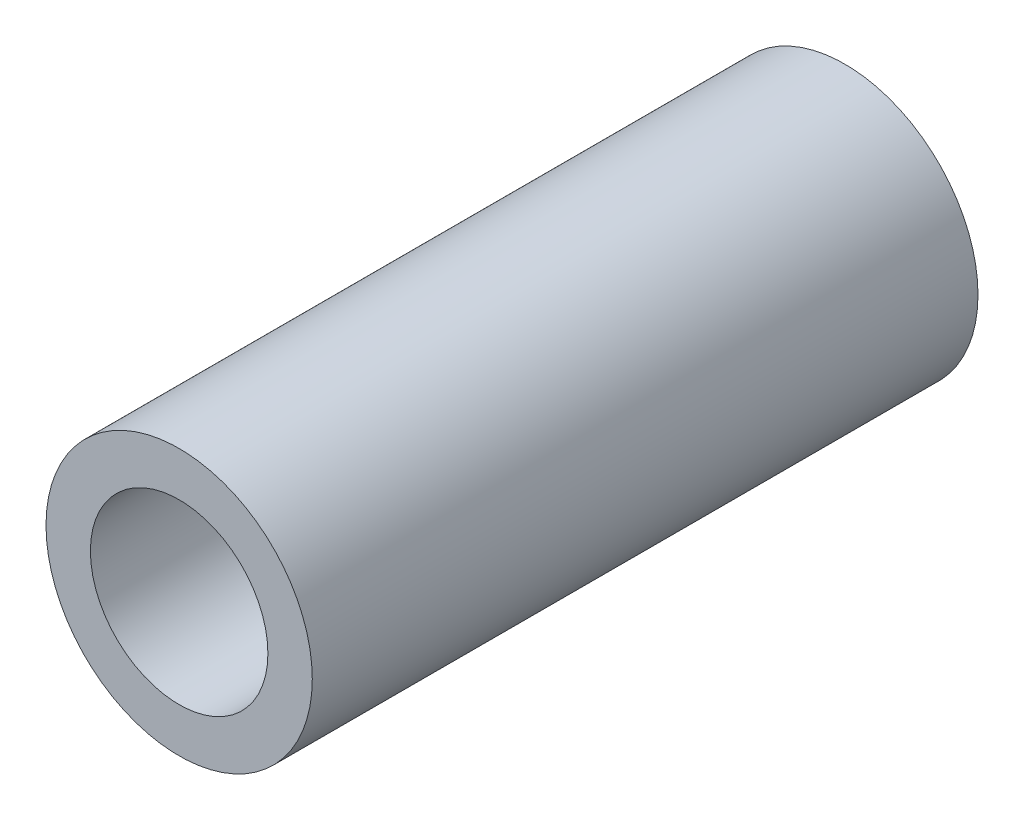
from build123d import *

# Parameters (mm, degrees)
ESQUISSE1_R      = 3
ESQUISSE1_R_2    = 2
EXTRUSION1_DEPTH = 15


with BuildPart() as part:
    # Esquisse1 → Extrusion1 (new body)
    with BuildSketch(Plane.XY):
        Circle(ESQUISSE1_R)
        Circle(ESQUISSE1_R_2, mode=Mode.SUBTRACT)
    extrude(amount=EXTRUSION1_DEPTH)


solid = part.part
